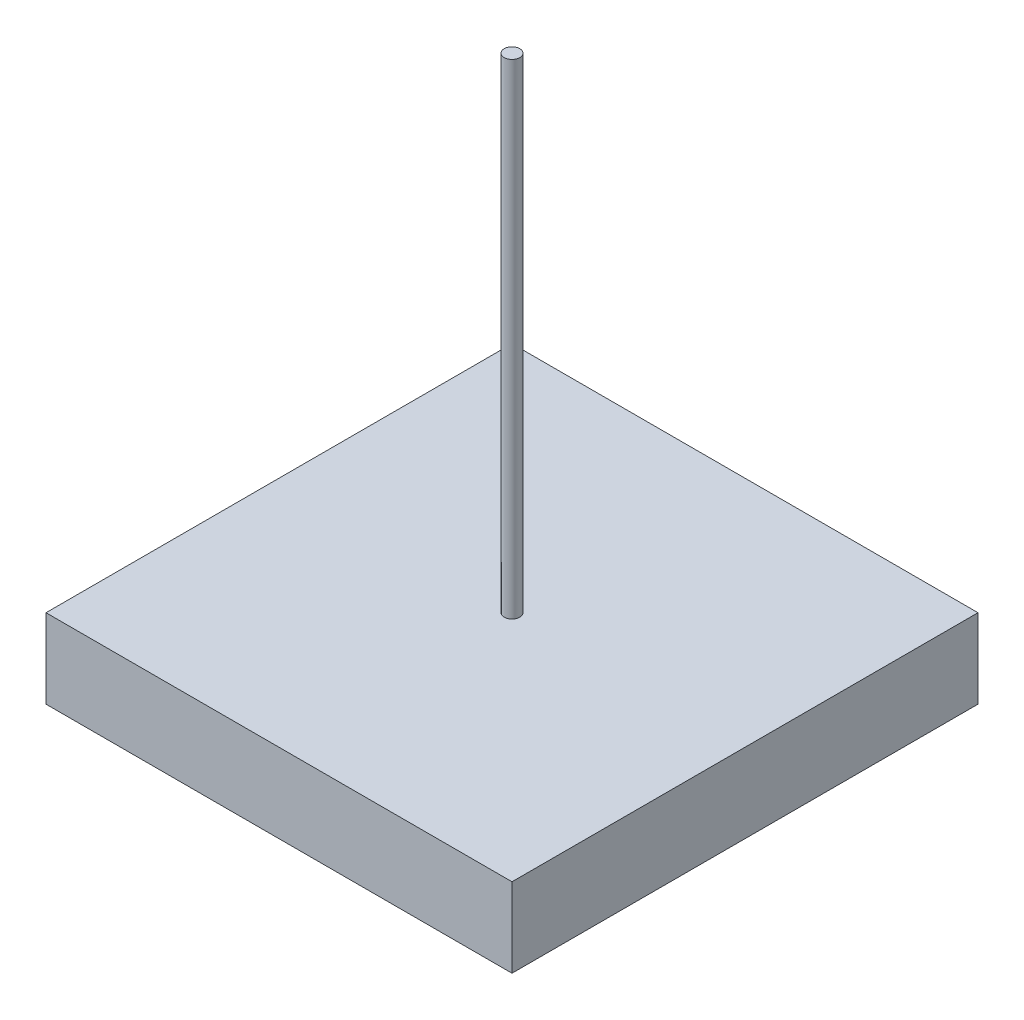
from build123d import *

# Parameters (mm, degrees)
SKIZZE1_W                       = 300
SKIZZE1_H                       = 300
AUFSATZ_LINEAR_AUSTRAGEN1_DEPTH = 3
SKIZZE2_W                       = 300
SKIZZE2_H                       = 300
SKIZZE2_W_2                     = 294
SKIZZE2_H_2                     = 294
AUFSATZ_LINEAR_AUSTRAGEN2_DEPTH = 45
SKIZZE3_R                       = 5
AUFSATZ_LINEAR_AUSTRAGEN3_DEPTH = 360
SKIZZE5_W                       = 300
SKIZZE5_H                       = 300
AUFSATZ_LINEAR_AUSTRAGEN4_DEPTH = 3


with BuildPart() as part:
    # Skizze1 → Aufsatz-Linear austragen1 (new body)
    with BuildSketch(Plane(origin=(0, 0, 0), x_dir=(1, 0, 0), z_dir=(0, 1, 0))):
        Rectangle(SKIZZE1_W, SKIZZE1_H)
    extrude(amount=AUFSATZ_LINEAR_AUSTRAGEN1_DEPTH)

    # Skizze2 → Aufsatz-Linear austragen2 (add)
    with BuildSketch(Plane(origin=(0, 3, 0), x_dir=(1, 0, 0), z_dir=(0, 1, 0))):
        Rectangle(SKIZZE2_W, SKIZZE2_H)
        Rectangle(SKIZZE2_W_2, SKIZZE2_H_2, mode=Mode.SUBTRACT)
    extrude(amount=AUFSATZ_LINEAR_AUSTRAGEN2_DEPTH)

    # Skizze3 → Aufsatz-Linear austragen3 (add)
    with BuildSketch(Plane(origin=(0, 3, 0), x_dir=(1, 0, 0), z_dir=(0, 1, 0))):
        with Locations(Location((0, 0, 0), (0, 0, 90))):
            Circle(SKIZZE3_R)
    extrude(amount=AUFSATZ_LINEAR_AUSTRAGEN3_DEPTH)

    # Skizze5 → Aufsatz-Linear austragen4 (add)
    with BuildSketch(Plane(origin=(0, 48, 0), x_dir=(1, 0, 0), z_dir=(0, 1, 0))):
        Rectangle(SKIZZE5_W, SKIZZE5_H)
    extrude(amount=AUFSATZ_LINEAR_AUSTRAGEN4_DEPTH)


solid = part.part
